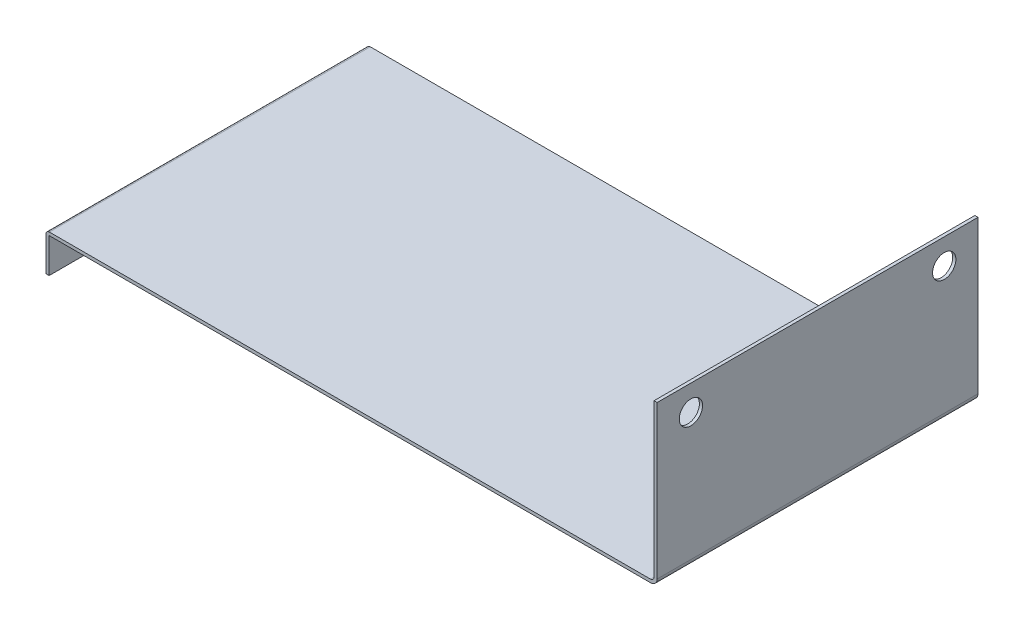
ISO-10303-21;
HEADER;
FILE_DESCRIPTION(('STEP AP214'),'2;1');
FILE_NAME('part.step','',(''),(''),'','','');
FILE_SCHEMA(('AUTOMOTIVE_DESIGN { 1 0 10303 214 1 1 1 1 }'));
ENDSEC;
DATA;
#1=APPLICATION_CONTEXT('core data for automotive mechanical design processes');
#2=APPLICATION_PROTOCOL_DEFINITION('international standard','automotive_design',2000,#1);
#3=PRODUCT_CONTEXT('',#1,'mechanical');
#4=PRODUCT('Part','Part','',(#3));
#5=PRODUCT_RELATED_PRODUCT_CATEGORY('part','',(#4));
#6=PRODUCT_DEFINITION_FORMATION('','',#4);
#7=PRODUCT_DEFINITION_CONTEXT('part definition',#1,'design');
#8=PRODUCT_DEFINITION('design','',#6,#7);
#9=PRODUCT_DEFINITION_SHAPE('','',#8);
#10=(LENGTH_UNIT() NAMED_UNIT(*) SI_UNIT(.MILLI.,.METRE.));
#11=(NAMED_UNIT(*) PLANE_ANGLE_UNIT() SI_UNIT($,.RADIAN.));
#12=(NAMED_UNIT(*) SI_UNIT($,.STERADIAN.) SOLID_ANGLE_UNIT());
#13=UNCERTAINTY_MEASURE_WITH_UNIT(LENGTH_MEASURE(1.E-05),#10,'distance_accuracy_value','');
#14=(GEOMETRIC_REPRESENTATION_CONTEXT(3) GLOBAL_UNCERTAINTY_ASSIGNED_CONTEXT((#13)) GLOBAL_UNIT_ASSIGNED_CONTEXT((#10,
#11,#12)) REPRESENTATION_CONTEXT('',''));
#15=CARTESIAN_POINT('',(0.,0.,0.));
#16=DIRECTION('',(0.,0.,1.));
#17=DIRECTION('',(1.,0.,0.));
#18=AXIS2_PLACEMENT_3D('',#15,#16,#17);
#19=CARTESIAN_POINT('',(230.9622,2.54000000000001,120.65));
#20=DIRECTION('',(-1.,0.,0.));
#21=DIRECTION('',(0.,0.,1.));
#22=AXIS2_PLACEMENT_3D('',#19,#20,#21);
#23=PLANE('',#22);
#24=CARTESIAN_POINT('',(230.9622,98.425,-95.25));
#25=DIRECTION('',(1.,0.,0.));
#26=DIRECTION('',(0.,1.,0.));
#27=AXIS2_PLACEMENT_3D('',#24,#25,#26);
#28=CIRCLE('',#27,8.76299999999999);
#29=CARTESIAN_POINT('',(230.9622,107.188,-95.25));
#30=VERTEX_POINT('',#29);
#31=EDGE_CURVE('E571',#30,#30,#28,.T.);
#32=ORIENTED_EDGE('',*,*,#31,.F.);
#33=EDGE_LOOP('',(#32));
#34=FACE_BOUND('',#33,.T.);
#35=CARTESIAN_POINT('',(230.9622,98.425,95.25));
#36=DIRECTION('',(1.,0.,0.));
#37=DIRECTION('',(0.,1.,0.));
#38=AXIS2_PLACEMENT_3D('',#35,#36,#37);
#39=CIRCLE('',#38,8.76299999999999);
#40=CARTESIAN_POINT('',(230.9622,107.188,95.25));
#41=VERTEX_POINT('',#40);
#42=EDGE_CURVE('E568',#41,#41,#39,.T.);
#43=ORIENTED_EDGE('',*,*,#42,.F.);
#44=EDGE_LOOP('',(#43));
#45=FACE_BOUND('',#44,.T.);
#46=DIRECTION('',(0.,1.,0.));
#47=VECTOR('',#46,1.);
#48=CARTESIAN_POINT('',(230.9622,2.54000000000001,-120.65));
#49=LINE('',#48,#47);
#50=CARTESIAN_POINT('',(230.9622,2.54000000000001,-120.65));
#51=VERTEX_POINT('',#50);
#52=CARTESIAN_POINT('',(230.9622,117.475,-120.65));
#53=VERTEX_POINT('',#52);
#54=EDGE_CURVE('E480',#51,#53,#49,.T.);
#55=ORIENTED_EDGE('',*,*,#54,.T.);
#56=DIRECTION('',(0.,0.,-1.));
#57=VECTOR('',#56,1.);
#58=CARTESIAN_POINT('',(230.9622,117.475,120.65));
#59=LINE('',#58,#57);
#60=CARTESIAN_POINT('',(230.9622,117.475,120.65));
#61=VERTEX_POINT('',#60);
#62=EDGE_CURVE('E11',#61,#53,#59,.T.);
#63=ORIENTED_EDGE('',*,*,#62,.F.);
#64=DIRECTION('',(0.,1.,0.));
#65=VECTOR('',#64,1.);
#66=CARTESIAN_POINT('',(230.9622,2.54000000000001,120.65));
#67=LINE('',#66,#65);
#68=CARTESIAN_POINT('',(230.9622,2.54000000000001,120.65));
#69=VERTEX_POINT('',#68);
#70=EDGE_CURVE('E516',#69,#61,#67,.T.);
#71=ORIENTED_EDGE('',*,*,#70,.F.);
#72=DIRECTION('',(0.,0.,-1.));
#73=VECTOR('',#72,1.);
#74=CARTESIAN_POINT('',(230.9622,2.54000000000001,120.65));
#75=LINE('',#74,#73);
#76=EDGE_CURVE('E481',#69,#51,#75,.T.);
#77=ORIENTED_EDGE('',*,*,#76,.T.);
#78=EDGE_LOOP('',(#55,#63,#71,#77));
#79=FACE_BOUND('',#78,.T.);
#80=ADVANCED_FACE('F380',(#34,#45,#79),#23,.F.);
#81=CARTESIAN_POINT('',(228.6,117.475,120.65));
#82=DIRECTION('',(0.,1.,0.));
#83=DIRECTION('',(0.,0.,1.));
#84=AXIS2_PLACEMENT_3D('',#81,#82,#83);
#85=PLANE('',#84);
#86=DIRECTION('',(1.,0.,0.));
#87=VECTOR('',#86,1.);
#88=CARTESIAN_POINT('',(228.6,117.475,-120.65));
#89=LINE('',#88,#87);
#90=CARTESIAN_POINT('',(228.6,117.475,-120.65));
#91=VERTEX_POINT('',#90);
#92=EDGE_CURVE('E472',#91,#53,#89,.T.);
#93=ORIENTED_EDGE('',*,*,#92,.F.);
#94=DIRECTION('',(0.,0.,-1.));
#95=VECTOR('',#94,1.);
#96=CARTESIAN_POINT('',(228.6,117.475,120.65));
#97=LINE('',#96,#95);
#98=CARTESIAN_POINT('',(228.6,117.475,120.65));
#99=VERTEX_POINT('',#98);
#100=EDGE_CURVE('E388',#99,#91,#97,.T.);
#101=ORIENTED_EDGE('',*,*,#100,.F.);
#102=DIRECTION('',(1.,0.,0.));
#103=VECTOR('',#102,1.);
#104=CARTESIAN_POINT('',(228.6,117.475,120.65));
#105=LINE('',#104,#103);
#106=EDGE_CURVE('E475',#99,#61,#105,.T.);
#107=ORIENTED_EDGE('',*,*,#106,.T.);
#108=ORIENTED_EDGE('',*,*,#62,.T.);
#109=EDGE_LOOP('',(#93,#101,#107,#108));
#110=FACE_BOUND('',#109,.T.);
#111=ADVANCED_FACE('F470',(#110),#85,.T.);
#112=CARTESIAN_POINT('',(228.6,2.54000000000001,120.65));
#113=DIRECTION('',(-1.,0.,0.));
#114=DIRECTION('',(0.,0.,1.));
#115=AXIS2_PLACEMENT_3D('',#112,#113,#114);
#116=PLANE('',#115);
#117=CARTESIAN_POINT('',(228.6,98.425,-95.25));
#118=DIRECTION('',(-1.,0.,0.));
#119=DIRECTION('',(0.,0.,1.));
#120=AXIS2_PLACEMENT_3D('',#117,#118,#119);
#121=CIRCLE('',#120,8.76299999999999);
#122=CARTESIAN_POINT('',(228.6,98.425,-86.487));
#123=VERTEX_POINT('',#122);
#124=EDGE_CURVE('E569',#123,#123,#121,.T.);
#125=ORIENTED_EDGE('',*,*,#124,.F.);
#126=EDGE_LOOP('',(#125));
#127=FACE_BOUND('',#126,.T.);
#128=CARTESIAN_POINT('',(228.6,98.425,95.25));
#129=DIRECTION('',(-1.,0.,0.));
#130=DIRECTION('',(0.,0.,1.));
#131=AXIS2_PLACEMENT_3D('',#128,#129,#130);
#132=CIRCLE('',#131,8.76299999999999);
#133=CARTESIAN_POINT('',(228.6,98.425,104.013));
#134=VERTEX_POINT('',#133);
#135=EDGE_CURVE('E484',#134,#134,#132,.T.);
#136=ORIENTED_EDGE('',*,*,#135,.F.);
#137=EDGE_LOOP('',(#136));
#138=FACE_BOUND('',#137,.T.);
#139=DIRECTION('',(0.,1.,0.));
#140=VECTOR('',#139,1.);
#141=CARTESIAN_POINT('',(228.6,2.54000000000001,-120.65));
#142=LINE('',#141,#140);
#143=CARTESIAN_POINT('',(228.6,2.54000000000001,-120.65));
#144=VERTEX_POINT('',#143);
#145=EDGE_CURVE('E489',#144,#91,#142,.T.);
#146=ORIENTED_EDGE('',*,*,#145,.F.);
#147=DIRECTION('',(0.,0.,-1.));
#148=VECTOR('',#147,1.);
#149=CARTESIAN_POINT('',(228.6,2.54000000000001,120.65));
#150=LINE('',#149,#148);
#151=CARTESIAN_POINT('',(228.6,2.54000000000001,120.65));
#152=VERTEX_POINT('',#151);
#153=EDGE_CURVE('E563',#152,#144,#150,.T.);
#154=ORIENTED_EDGE('',*,*,#153,.F.);
#155=DIRECTION('',(0.,1.,0.));
#156=VECTOR('',#155,1.);
#157=CARTESIAN_POINT('',(228.6,2.54000000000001,120.65));
#158=LINE('',#157,#156);
#159=EDGE_CURVE('E519',#152,#99,#158,.T.);
#160=ORIENTED_EDGE('',*,*,#159,.T.);
#161=ORIENTED_EDGE('',*,*,#100,.T.);
#162=EDGE_LOOP('',(#146,#154,#160,#161));
#163=FACE_BOUND('',#162,.T.);
#164=ADVANCED_FACE('F598',(#127,#138,#163),#116,.T.);
#165=CARTESIAN_POINT('',(226.06,2.54000000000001,120.65));
#166=DIRECTION('',(0.,0.,-1.));
#167=DIRECTION('',(-1.,0.,0.));
#168=AXIS2_PLACEMENT_3D('',#165,#166,#167);
#169=CYLINDRICAL_SURFACE('',#168,2.54000000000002);
#170=CARTESIAN_POINT('',(226.06,2.54000000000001,-120.65));
#171=DIRECTION('',(0.,0.,1.));
#172=DIRECTION('',(1.,0.,0.));
#173=AXIS2_PLACEMENT_3D('',#170,#171,#172);
#174=CIRCLE('',#173,2.54000000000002);
#175=CARTESIAN_POINT('',(226.06,0.,-120.65));
#176=VERTEX_POINT('',#175);
#177=EDGE_CURVE('E491',#176,#144,#174,.T.);
#178=ORIENTED_EDGE('',*,*,#177,.F.);
#179=DIRECTION('',(0.,0.,-1.));
#180=VECTOR('',#179,1.);
#181=CARTESIAN_POINT('',(226.06,0.,120.65));
#182=LINE('',#181,#180);
#183=CARTESIAN_POINT('',(226.06,0.,120.65));
#184=VERTEX_POINT('',#183);
#185=EDGE_CURVE('E561',#184,#176,#182,.T.);
#186=ORIENTED_EDGE('',*,*,#185,.F.);
#187=CARTESIAN_POINT('',(226.06,2.54000000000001,120.65));
#188=DIRECTION('',(0.,0.,1.));
#189=DIRECTION('',(1.,0.,0.));
#190=AXIS2_PLACEMENT_3D('',#187,#188,#189);
#191=CIRCLE('',#190,2.54000000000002);
#192=EDGE_CURVE('E522',#184,#152,#191,.T.);
#193=ORIENTED_EDGE('',*,*,#192,.T.);
#194=ORIENTED_EDGE('',*,*,#153,.T.);
#195=EDGE_LOOP('',(#178,#186,#193,#194));
#196=FACE_BOUND('',#195,.T.);
#197=ADVANCED_FACE('F652',(#196),#169,.F.);
#198=CARTESIAN_POINT('',(-226.06,0.,120.65));
#199=DIRECTION('',(0.,1.,0.));
#200=DIRECTION('',(0.,0.,1.));
#201=AXIS2_PLACEMENT_3D('',#198,#199,#200);
#202=PLANE('',#201);
#203=DIRECTION('',(1.,0.,0.));
#204=VECTOR('',#203,1.);
#205=CARTESIAN_POINT('',(-226.06,0.,-120.65));
#206=LINE('',#205,#204);
#207=CARTESIAN_POINT('',(-226.06,0.,-120.65));
#208=VERTEX_POINT('',#207);
#209=EDGE_CURVE('E496',#208,#176,#206,.T.);
#210=ORIENTED_EDGE('',*,*,#209,.F.);
#211=DIRECTION('',(0.,0.,-1.));
#212=VECTOR('',#211,1.);
#213=CARTESIAN_POINT('',(-226.06,0.,120.65));
#214=LINE('',#213,#212);
#215=CARTESIAN_POINT('',(-226.06,0.,120.65));
#216=VERTEX_POINT('',#215);
#217=EDGE_CURVE('E559',#216,#208,#214,.T.);
#218=ORIENTED_EDGE('',*,*,#217,.F.);
#219=DIRECTION('',(1.,0.,0.));
#220=VECTOR('',#219,1.);
#221=CARTESIAN_POINT('',(-226.06,0.,120.65));
#222=LINE('',#221,#220);
#223=EDGE_CURVE('E525',#216,#184,#222,.T.);
#224=ORIENTED_EDGE('',*,*,#223,.T.);
#225=ORIENTED_EDGE('',*,*,#185,.T.);
#226=EDGE_LOOP('',(#210,#218,#224,#225));
#227=FACE_BOUND('',#226,.T.);
#228=ADVANCED_FACE('F648',(#227),#202,.T.);
#229=CARTESIAN_POINT('',(-226.06,-2.54000000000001,120.65));
#230=DIRECTION('',(0.,0.,-1.));
#231=DIRECTION('',(-1.,0.,0.));
#232=AXIS2_PLACEMENT_3D('',#229,#230,#231);
#233=CYLINDRICAL_SURFACE('',#232,2.54000000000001);
#234=CARTESIAN_POINT('',(-226.06,-2.54000000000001,-120.65));
#235=DIRECTION('',(0.,0.,-1.));
#236=DIRECTION('',(-1.,0.,0.));
#237=AXIS2_PLACEMENT_3D('',#234,#235,#236);
#238=CIRCLE('',#237,2.54000000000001);
#239=CARTESIAN_POINT('',(-228.6,-2.54000000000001,-120.65));
#240=VERTEX_POINT('',#239);
#241=EDGE_CURVE('E499',#240,#208,#238,.T.);
#242=ORIENTED_EDGE('',*,*,#241,.F.);
#243=DIRECTION('',(0.,0.,-1.));
#244=VECTOR('',#243,1.);
#245=CARTESIAN_POINT('',(-228.6,-2.54000000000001,120.65));
#246=LINE('',#245,#244);
#247=CARTESIAN_POINT('',(-228.6,-2.54000000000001,120.65));
#248=VERTEX_POINT('',#247);
#249=EDGE_CURVE('E557',#248,#240,#246,.T.);
#250=ORIENTED_EDGE('',*,*,#249,.F.);
#251=CARTESIAN_POINT('',(-226.06,-2.54000000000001,120.65));
#252=DIRECTION('',(0.,0.,-1.));
#253=DIRECTION('',(-1.,0.,0.));
#254=AXIS2_PLACEMENT_3D('',#251,#252,#253);
#255=CIRCLE('',#254,2.54000000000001);
#256=EDGE_CURVE('E528',#248,#216,#255,.T.);
#257=ORIENTED_EDGE('',*,*,#256,.T.);
#258=ORIENTED_EDGE('',*,*,#217,.T.);
#259=EDGE_LOOP('',(#242,#250,#257,#258));
#260=FACE_BOUND('',#259,.T.);
#261=ADVANCED_FACE('F644',(#260),#233,.T.);
#262=CARTESIAN_POINT('',(-228.6,-28.448,120.65));
#263=DIRECTION('',(-1.,0.,0.));
#264=DIRECTION('',(0.,0.,1.));
#265=AXIS2_PLACEMENT_3D('',#262,#263,#264);
#266=PLANE('',#265);
#267=CARTESIAN_POINT('',(-228.6,-15.748,-88.9));
#268=DIRECTION('',(1.,0.,0.));
#269=DIRECTION('',(0.,1.,0.));
#270=AXIS2_PLACEMENT_3D('',#267,#268,#269);
#271=CIRCLE('',#270,5.20700000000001);
#272=CARTESIAN_POINT('',(-228.6,-10.541,-88.9));
#273=VERTEX_POINT('',#272);
#274=EDGE_CURVE('E584',#273,#273,#271,.T.);
#275=ORIENTED_EDGE('',*,*,#274,.T.);
#276=EDGE_LOOP('',(#275));
#277=FACE_BOUND('',#276,.T.);
#278=CARTESIAN_POINT('',(-228.6,-15.748,88.9));
#279=DIRECTION('',(1.,0.,0.));
#280=DIRECTION('',(0.,1.,0.));
#281=AXIS2_PLACEMENT_3D('',#278,#279,#280);
#282=CIRCLE('',#281,5.20700000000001);
#283=CARTESIAN_POINT('',(-228.6,-10.541,88.9));
#284=VERTEX_POINT('',#283);
#285=EDGE_CURVE('E574',#284,#284,#282,.T.);
#286=ORIENTED_EDGE('',*,*,#285,.T.);
#287=EDGE_LOOP('',(#286));
#288=FACE_BOUND('',#287,.T.);
#289=DIRECTION('',(0.,1.,0.));
#290=VECTOR('',#289,1.);
#291=CARTESIAN_POINT('',(-228.6,-28.448,-120.65));
#292=LINE('',#291,#290);
#293=CARTESIAN_POINT('',(-228.6,-28.448,-120.65));
#294=VERTEX_POINT('',#293);
#295=EDGE_CURVE('E502',#294,#240,#292,.T.);
#296=ORIENTED_EDGE('',*,*,#295,.F.);
#297=DIRECTION('',(0.,0.,-1.));
#298=VECTOR('',#297,1.);
#299=CARTESIAN_POINT('',(-228.6,-28.448,120.65));
#300=LINE('',#299,#298);
#301=CARTESIAN_POINT('',(-228.6,-28.448,120.65));
#302=VERTEX_POINT('',#301);
#303=EDGE_CURVE('E555',#302,#294,#300,.T.);
#304=ORIENTED_EDGE('',*,*,#303,.F.);
#305=DIRECTION('',(0.,1.,0.));
#306=VECTOR('',#305,1.);
#307=CARTESIAN_POINT('',(-228.6,-28.448,120.65));
#308=LINE('',#307,#306);
#309=EDGE_CURVE('E531',#302,#248,#308,.T.);
#310=ORIENTED_EDGE('',*,*,#309,.T.);
#311=ORIENTED_EDGE('',*,*,#249,.T.);
#312=EDGE_LOOP('',(#296,#304,#310,#311));
#313=FACE_BOUND('',#312,.T.);
#314=ADVANCED_FACE('F640',(#277,#288,#313),#266,.T.);
#315=CARTESIAN_POINT('',(-226.2378,-28.448,120.65));
#316=DIRECTION('',(0.,-1.,0.));
#317=DIRECTION('',(0.,0.,-1.));
#318=AXIS2_PLACEMENT_3D('',#315,#316,#317);
#319=PLANE('',#318);
#320=DIRECTION('',(-1.,0.,0.));
#321=VECTOR('',#320,1.);
#322=CARTESIAN_POINT('',(-226.2378,-28.448,-120.65));
#323=LINE('',#322,#321);
#324=CARTESIAN_POINT('',(-226.2378,-28.448,-120.65));
#325=VERTEX_POINT('',#324);
#326=EDGE_CURVE('E505',#325,#294,#323,.T.);
#327=ORIENTED_EDGE('',*,*,#326,.F.);
#328=DIRECTION('',(0.,0.,-1.));
#329=VECTOR('',#328,1.);
#330=CARTESIAN_POINT('',(-226.2378,-28.448,120.65));
#331=LINE('',#330,#329);
#332=CARTESIAN_POINT('',(-226.2378,-28.448,120.65));
#333=VERTEX_POINT('',#332);
#334=EDGE_CURVE('E553',#333,#325,#331,.T.);
#335=ORIENTED_EDGE('',*,*,#334,.F.);
#336=DIRECTION('',(-1.,0.,0.));
#337=VECTOR('',#336,1.);
#338=CARTESIAN_POINT('',(-226.2378,-28.448,120.65));
#339=LINE('',#338,#337);
#340=EDGE_CURVE('E534',#333,#302,#339,.T.);
#341=ORIENTED_EDGE('',*,*,#340,.T.);
#342=ORIENTED_EDGE('',*,*,#303,.T.);
#343=EDGE_LOOP('',(#327,#335,#341,#342));
#344=FACE_BOUND('',#343,.T.);
#345=ADVANCED_FACE('F636',(#344),#319,.T.);
#346=CARTESIAN_POINT('',(-226.2378,-28.448,120.65));
#347=DIRECTION('',(-1.,0.,0.));
#348=DIRECTION('',(0.,0.,1.));
#349=AXIS2_PLACEMENT_3D('',#346,#347,#348);
#350=PLANE('',#349);
#351=CARTESIAN_POINT('',(-226.2378,-15.748,-88.9));
#352=DIRECTION('',(-1.,0.,0.));
#353=DIRECTION('',(0.,0.,1.));
#354=AXIS2_PLACEMENT_3D('',#351,#352,#353);
#355=CIRCLE('',#354,5.20700000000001);
#356=CARTESIAN_POINT('',(-226.2378,-15.748,-83.693));
#357=VERTEX_POINT('',#356);
#358=EDGE_CURVE('E383',#357,#357,#355,.T.);
#359=ORIENTED_EDGE('',*,*,#358,.T.);
#360=EDGE_LOOP('',(#359));
#361=FACE_BOUND('',#360,.T.);
#362=CARTESIAN_POINT('',(-226.2378,-15.748,88.9));
#363=DIRECTION('',(-1.,0.,0.));
#364=DIRECTION('',(0.,0.,1.));
#365=AXIS2_PLACEMENT_3D('',#362,#363,#364);
#366=CIRCLE('',#365,5.20700000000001);
#367=CARTESIAN_POINT('',(-226.2378,-15.748,94.107));
#368=VERTEX_POINT('',#367);
#369=EDGE_CURVE('E572',#368,#368,#366,.T.);
#370=ORIENTED_EDGE('',*,*,#369,.T.);
#371=EDGE_LOOP('',(#370));
#372=FACE_BOUND('',#371,.T.);
#373=DIRECTION('',(0.,1.,0.));
#374=VECTOR('',#373,1.);
#375=CARTESIAN_POINT('',(-226.2378,-28.448,-120.65));
#376=LINE('',#375,#374);
#377=CARTESIAN_POINT('',(-226.2378,-2.54000000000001,-120.65));
#378=VERTEX_POINT('',#377);
#379=EDGE_CURVE('E508',#325,#378,#376,.T.);
#380=ORIENTED_EDGE('',*,*,#379,.T.);
#381=DIRECTION('',(0.,0.,-1.));
#382=VECTOR('',#381,1.);
#383=CARTESIAN_POINT('',(-226.2378,-2.54000000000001,120.65));
#384=LINE('',#383,#382);
#385=CARTESIAN_POINT('',(-226.2378,-2.54000000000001,120.65));
#386=VERTEX_POINT('',#385);
#387=EDGE_CURVE('E550',#386,#378,#384,.T.);
#388=ORIENTED_EDGE('',*,*,#387,.F.);
#389=DIRECTION('',(0.,1.,0.));
#390=VECTOR('',#389,1.);
#391=CARTESIAN_POINT('',(-226.2378,-28.448,120.65));
#392=LINE('',#391,#390);
#393=EDGE_CURVE('E537',#333,#386,#392,.T.);
#394=ORIENTED_EDGE('',*,*,#393,.F.);
#395=ORIENTED_EDGE('',*,*,#334,.T.);
#396=EDGE_LOOP('',(#380,#388,#394,#395));
#397=FACE_BOUND('',#396,.T.);
#398=ADVANCED_FACE('F632',(#361,#372,#397),#350,.F.);
#399=CARTESIAN_POINT('',(-226.06,-2.54000000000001,120.65));
#400=DIRECTION('',(0.,0.,-1.));
#401=DIRECTION('',(-1.,0.,0.));
#402=AXIS2_PLACEMENT_3D('',#399,#400,#401);
#403=CYLINDRICAL_SURFACE('',#402,0.177800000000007);
#404=CARTESIAN_POINT('',(-226.06,-2.54000000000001,-120.65));
#405=DIRECTION('',(0.,0.,1.));
#406=DIRECTION('',(1.,0.,0.));
#407=AXIS2_PLACEMENT_3D('',#404,#405,#406);
#408=CIRCLE('',#407,0.177800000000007);
#409=CARTESIAN_POINT('',(-226.06,-2.36220000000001,-120.65));
#410=VERTEX_POINT('',#409);
#411=EDGE_CURVE('E510',#378,#410,#408,.F.);
#412=ORIENTED_EDGE('',*,*,#411,.T.);
#413=DIRECTION('',(0.,0.,-1.));
#414=VECTOR('',#413,1.);
#415=CARTESIAN_POINT('',(-226.06,-2.36220000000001,120.65));
#416=LINE('',#415,#414);
#417=CARTESIAN_POINT('',(-226.06,-2.36220000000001,120.65));
#418=VERTEX_POINT('',#417);
#419=EDGE_CURVE('E547',#418,#410,#416,.T.);
#420=ORIENTED_EDGE('',*,*,#419,.F.);
#421=CARTESIAN_POINT('',(-226.06,-2.54000000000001,120.65));
#422=DIRECTION('',(0.,0.,1.));
#423=DIRECTION('',(1.,0.,0.));
#424=AXIS2_PLACEMENT_3D('',#421,#422,#423);
#425=CIRCLE('',#424,0.177800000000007);
#426=EDGE_CURVE('E539',#386,#418,#425,.F.);
#427=ORIENTED_EDGE('',*,*,#426,.F.);
#428=ORIENTED_EDGE('',*,*,#387,.T.);
#429=EDGE_LOOP('',(#412,#420,#427,#428));
#430=FACE_BOUND('',#429,.T.);
#431=ADVANCED_FACE('F628',(#430),#403,.F.);
#432=CARTESIAN_POINT('',(-226.06,-2.36220000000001,120.65));
#433=DIRECTION('',(0.,1.,0.));
#434=DIRECTION('',(0.,0.,1.));
#435=AXIS2_PLACEMENT_3D('',#432,#433,#434);
#436=PLANE('',#435);
#437=DIRECTION('',(1.,0.,0.));
#438=VECTOR('',#437,1.);
#439=CARTESIAN_POINT('',(-226.06,-2.36220000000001,-120.65));
#440=LINE('',#439,#438);
#441=CARTESIAN_POINT('',(226.06,-2.36220000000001,-120.65));
#442=VERTEX_POINT('',#441);
#443=EDGE_CURVE('E512',#410,#442,#440,.T.);
#444=ORIENTED_EDGE('',*,*,#443,.T.);
#445=DIRECTION('',(0.,0.,-1.));
#446=VECTOR('',#445,1.);
#447=CARTESIAN_POINT('',(226.06,-2.36220000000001,120.65));
#448=LINE('',#447,#446);
#449=CARTESIAN_POINT('',(226.06,-2.36220000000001,120.65));
#450=VERTEX_POINT('',#449);
#451=EDGE_CURVE('E544',#450,#442,#448,.T.);
#452=ORIENTED_EDGE('',*,*,#451,.F.);
#453=DIRECTION('',(1.,0.,0.));
#454=VECTOR('',#453,1.);
#455=CARTESIAN_POINT('',(-226.06,-2.36220000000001,120.65));
#456=LINE('',#455,#454);
#457=EDGE_CURVE('E401',#418,#450,#456,.T.);
#458=ORIENTED_EDGE('',*,*,#457,.F.);
#459=ORIENTED_EDGE('',*,*,#419,.T.);
#460=EDGE_LOOP('',(#444,#452,#458,#459));
#461=FACE_BOUND('',#460,.T.);
#462=ADVANCED_FACE('F624',(#461),#436,.F.);
#463=CARTESIAN_POINT('',(226.06,2.54000000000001,120.65));
#464=DIRECTION('',(0.,0.,-1.));
#465=DIRECTION('',(-1.,0.,0.));
#466=AXIS2_PLACEMENT_3D('',#463,#464,#465);
#467=CYLINDRICAL_SURFACE('',#466,4.90220000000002);
#468=CARTESIAN_POINT('',(226.06,2.54000000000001,-120.65));
#469=DIRECTION('',(0.,0.,1.));
#470=DIRECTION('',(1.,0.,0.));
#471=AXIS2_PLACEMENT_3D('',#468,#469,#470);
#472=CIRCLE('',#471,4.90220000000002);
#473=EDGE_CURVE('E514',#442,#51,#472,.T.);
#474=ORIENTED_EDGE('',*,*,#473,.T.);
#475=ORIENTED_EDGE('',*,*,#76,.F.);
#476=CARTESIAN_POINT('',(226.06,2.54000000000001,120.65));
#477=DIRECTION('',(0.,0.,1.));
#478=DIRECTION('',(1.,0.,0.));
#479=AXIS2_PLACEMENT_3D('',#476,#477,#478);
#480=CIRCLE('',#479,4.90220000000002);
#481=EDGE_CURVE('E396',#450,#69,#480,.T.);
#482=ORIENTED_EDGE('',*,*,#481,.F.);
#483=ORIENTED_EDGE('',*,*,#451,.T.);
#484=EDGE_LOOP('',(#474,#475,#482,#483));
#485=FACE_BOUND('',#484,.T.);
#486=ADVANCED_FACE('F621',(#485),#467,.T.);
#487=CARTESIAN_POINT('',(226.06,2.54000000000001,120.65));
#488=DIRECTION('',(0.,0.,1.));
#489=DIRECTION('',(1.,0.,0.));
#490=AXIS2_PLACEMENT_3D('',#487,#488,#489);
#491=PLANE('',#490);
#492=ORIENTED_EDGE('',*,*,#70,.T.);
#493=ORIENTED_EDGE('',*,*,#106,.F.);
#494=ORIENTED_EDGE('',*,*,#159,.F.);
#495=ORIENTED_EDGE('',*,*,#192,.F.);
#496=ORIENTED_EDGE('',*,*,#223,.F.);
#497=ORIENTED_EDGE('',*,*,#256,.F.);
#498=ORIENTED_EDGE('',*,*,#309,.F.);
#499=ORIENTED_EDGE('',*,*,#340,.F.);
#500=ORIENTED_EDGE('',*,*,#393,.T.);
#501=ORIENTED_EDGE('',*,*,#426,.T.);
#502=ORIENTED_EDGE('',*,*,#457,.T.);
#503=ORIENTED_EDGE('',*,*,#481,.T.);
#504=EDGE_LOOP('',(#492,#493,#494,#495,#496,#497,#498,#499,#500,#501,#502,#503));
#505=FACE_BOUND('',#504,.T.);
#506=ADVANCED_FACE('F618',(#505),#491,.T.);
#507=CARTESIAN_POINT('',(226.06,2.54000000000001,-120.65));
#508=DIRECTION('',(0.,0.,1.));
#509=DIRECTION('',(1.,0.,0.));
#510=AXIS2_PLACEMENT_3D('',#507,#508,#509);
#511=PLANE('',#510);
#512=ORIENTED_EDGE('',*,*,#54,.F.);
#513=ORIENTED_EDGE('',*,*,#473,.F.);
#514=ORIENTED_EDGE('',*,*,#443,.F.);
#515=ORIENTED_EDGE('',*,*,#411,.F.);
#516=ORIENTED_EDGE('',*,*,#379,.F.);
#517=ORIENTED_EDGE('',*,*,#326,.T.);
#518=ORIENTED_EDGE('',*,*,#295,.T.);
#519=ORIENTED_EDGE('',*,*,#241,.T.);
#520=ORIENTED_EDGE('',*,*,#209,.T.);
#521=ORIENTED_EDGE('',*,*,#177,.T.);
#522=ORIENTED_EDGE('',*,*,#145,.T.);
#523=ORIENTED_EDGE('',*,*,#92,.T.);
#524=EDGE_LOOP('',(#512,#513,#514,#515,#516,#517,#518,#519,#520,#521,#522,#523));
#525=FACE_BOUND('',#524,.T.);
#526=ADVANCED_FACE('F486',(#525),#511,.F.);
#527=CARTESIAN_POINT('',(-228.6,98.4249999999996,95.25));
#528=DIRECTION('',(1.,0.,0.));
#529=DIRECTION('',(0.,1.,0.));
#530=AXIS2_PLACEMENT_3D('',#527,#528,#529);
#531=CYLINDRICAL_SURFACE('',#530,8.76299999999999);
#532=ORIENTED_EDGE('',*,*,#135,.T.);
#533=EDGE_LOOP('',(#532));
#534=FACE_BOUND('',#533,.T.);
#535=ORIENTED_EDGE('',*,*,#42,.T.);
#536=EDGE_LOOP('',(#535));
#537=FACE_BOUND('',#536,.T.);
#538=ADVANCED_FACE('F589',(#534,#537),#531,.F.);
#539=CARTESIAN_POINT('',(-228.6,98.4249999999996,-95.25));
#540=DIRECTION('',(1.,0.,0.));
#541=DIRECTION('',(0.,1.,0.));
#542=AXIS2_PLACEMENT_3D('',#539,#540,#541);
#543=CYLINDRICAL_SURFACE('',#542,8.76299999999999);
#544=ORIENTED_EDGE('',*,*,#124,.T.);
#545=EDGE_LOOP('',(#544));
#546=FACE_BOUND('',#545,.T.);
#547=ORIENTED_EDGE('',*,*,#31,.T.);
#548=EDGE_LOOP('',(#547));
#549=FACE_BOUND('',#548,.T.);
#550=ADVANCED_FACE('F601',(#546,#549),#543,.F.);
#551=CARTESIAN_POINT('',(-228.6,-15.748,88.9));
#552=DIRECTION('',(1.,0.,0.));
#553=DIRECTION('',(0.,1.,0.));
#554=AXIS2_PLACEMENT_3D('',#551,#552,#553);
#555=CYLINDRICAL_SURFACE('',#554,5.20700000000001);
#556=ORIENTED_EDGE('',*,*,#285,.F.);
#557=EDGE_LOOP('',(#556));
#558=FACE_BOUND('',#557,.T.);
#559=ORIENTED_EDGE('',*,*,#369,.F.);
#560=EDGE_LOOP('',(#559));
#561=FACE_BOUND('',#560,.T.);
#562=ADVANCED_FACE('F603',(#558,#561),#555,.F.);
#563=CARTESIAN_POINT('',(-228.6,-15.748,-88.9));
#564=DIRECTION('',(1.,0.,0.));
#565=DIRECTION('',(0.,1.,0.));
#566=AXIS2_PLACEMENT_3D('',#563,#564,#565);
#567=CYLINDRICAL_SURFACE('',#566,5.20700000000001);
#568=ORIENTED_EDGE('',*,*,#274,.F.);
#569=EDGE_LOOP('',(#568));
#570=FACE_BOUND('',#569,.T.);
#571=ORIENTED_EDGE('',*,*,#358,.F.);
#572=EDGE_LOOP('',(#571));
#573=FACE_BOUND('',#572,.T.);
#574=ADVANCED_FACE('F610',(#570,#573),#567,.F.);
#575=CLOSED_SHELL('',(#80,#111,#164,#197,#228,#261,#314,#345,#398,#431,#462,#486,#506,#526,#538,
#550,#562,#574));
#576=MANIFOLD_SOLID_BREP('B2',#575);
#577=ADVANCED_BREP_SHAPE_REPRESENTATION('',(#18,#576),#14);
#578=SHAPE_DEFINITION_REPRESENTATION(#9,#577);
ENDSEC;
END-ISO-10303-21;
